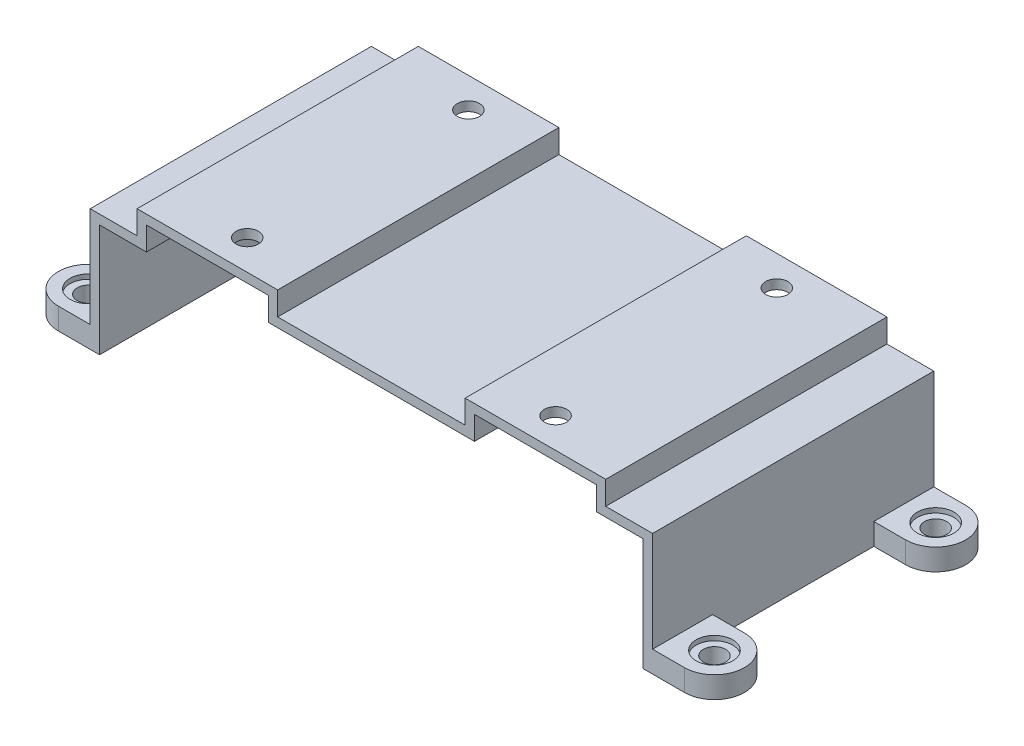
from build123d import *

# Parameters (mm, degrees)
EXTRUDE1_DEPTH           = 76.2
EXTRUDE2_DEPTH           = 5.842
SKETCH3_R                = 4.953
EXTRUDE3_DEPTH           = 1.27
B_0_238_DIAMETER_HOLE1_D = 6.0452
MIRROR2_COPY_1_DEPTH     = 5.842
MIRROR2_COPY_2_SKETCH_R  = 4.953
MIRROR2_COPY_2_DEPTH     = 1.27
MIRROR2_COPY_3_D         = 6.0452
SKETCH7_R                = 3.0226
EXTRUDE4_DEPTH           = 127.486134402


with BuildPart() as part:
    # Sketch1 → Extrude1 (new body)
    with BuildSketch(Plane.XY):
        Polygon((-25.4, 33.02), (25.4, 33.02), (25.4, 39.37), (63.5, 39.37), (63.5, 33.02), (76.2, 33.02), (76.2, 0), (73.66, 0), (73.66, 30.48), (60.96, 30.48), (60.96, 36.83), (27.94, 36.83), (27.94, 30.48), (-27.94, 30.48), (-27.94, 36.83), (-60.96, 36.83), (-60.96, 30.48), (-73.66, 30.48), (-73.66, 0), (-76.2, 0), (-76.2, 33.02), (-63.5, 33.02), (-63.5, 39.37), (-25.4, 39.37), align=None)
    extrude(amount=EXTRUDE1_DEPTH)

    # Sketch2 → Extrude2 (add)
    with BuildSketch(Plane.XZ):
        with BuildLine():
            Line((-76.2, 76.2), (-84.836, 76.2))
            ThreePointArc((-84.836, 76.2), (-92.964, 68.072), (-84.836, 59.944))
            Line((-84.836, 59.944), (-76.2, 59.944))
            Line((-76.2, 59.944), (-76.2, 76.2))
        make_face()
    extrude2 = extrude(amount=-EXTRUDE2_DEPTH)

    # Sketch3 → Extrude3 (cut)
    with BuildSketch(Plane(origin=(0, 5.842, 0), x_dir=(1, 0, 0), z_dir=(0, 1, 0))):
        with Locations(Location((-84.836, -68.072, 0), (0, 0, 180))):
            Circle(SKETCH3_R)
    extrude3 = extrude(amount=-EXTRUDE3_DEPTH, mode=Mode.SUBTRACT)

    # B _0.238_ Diameter Hole1 (through all)
    with Locations(Plane(origin=(-84.836, 4.572, 68.072), x_dir=(1, 0, 0), z_dir=(0, 1, 0))):
        with Locations((0, 0)):
            b_0_238_diameter_hole1 = Hole(B_0_238_DIAMETER_HOLE1_D / 2)

    # Mirror1: Extrude2, Extrude3, B _0.238_ Diameter Hole1 across plane
    add(extrude2.mirror(Plane(origin=(0, 0, 0), x_dir=(0, 0, 1), z_dir=(1, 0, 0))))
    add(extrude3.mirror(Plane(origin=(0, 0, 0), x_dir=(0, 0, 1), z_dir=(1, 0, 0))), mode=Mode.SUBTRACT)
    add(b_0_238_diameter_hole1.mirror(Plane(origin=(0, 0, 0), x_dir=(0, 0, 1), z_dir=(1, 0, 0))), mode=Mode.SUBTRACT)

    # Mirror2: Extrude2, Extrude3, B _0.238_ Diameter Hole1 across plane
    add(extrude2.mirror(Plane.XY.offset(38.1)))
    add(extrude3.mirror(Plane.XY.offset(38.1)), mode=Mode.SUBTRACT)
    add(b_0_238_diameter_hole1.mirror(Plane.XY.offset(38.1)), mode=Mode.SUBTRACT)

    # Mirror2 copy 1 sketch → Mirror2 copy 1 (add)
    with BuildSketch(Plane(origin=(0, 0, 76.2), x_dir=(-1, 0, 0), z_dir=(0, -1, 0))):
        with BuildLine():
            Line((-76.2, 76.2), (-84.836, 76.2))
            ThreePointArc((-84.836, 76.2), (-92.964, 68.072), (-84.836, 59.944))
            Line((-84.836, 59.944), (-76.2, 59.944))
            Line((-76.2, 59.944), (-76.2, 76.2))
        make_face()
    extrude(amount=-MIRROR2_COPY_1_DEPTH)

    # Mirror2 copy 2 sketch → Mirror2 copy 2 (cut)
    with BuildSketch(Plane(origin=(0, 5.842, 76.2), x_dir=(-1, 0, 0), z_dir=(0, 1, 0))):
        with Locations(Location((-84.836, -68.072, 0), (0, 0, 180))):
            Circle(MIRROR2_COPY_2_SKETCH_R)
    extrude(amount=-MIRROR2_COPY_2_DEPTH, mode=Mode.SUBTRACT)

    # Mirror2 copy 3 (through all)
    with Locations(Plane(origin=(84.836, 4.572, 8.128), x_dir=(-1, 0, 0), z_dir=(0, 1, 0))):
        with Locations((0, 0)):
            Hole(MIRROR2_COPY_3_D / 2)

    # Sketch7 → Extrude4 (cut, through all)
    with BuildSketch(Plane(origin=(0, 39.37, 0), x_dir=(1, 0, 0), z_dir=(0, 1, 0))):
        with Locations(Location((-41.783, -8.128, 0), (0, 0, 180))):
            Circle(SKETCH7_R)
        with Locations(Location((-41.783, -68.072, 0), (0, 0, 180))):
            Circle(SKETCH7_R)
        with Locations(Location((41.783, -8.128, 0), (0, 0, 180))):
            Circle(SKETCH7_R)
        with Locations(Location((41.783, -68.072, 0), (0, 0, 180))):
            Circle(SKETCH7_R)
    extrude(amount=-EXTRUDE4_DEPTH, mode=Mode.SUBTRACT)


solid = part.part
